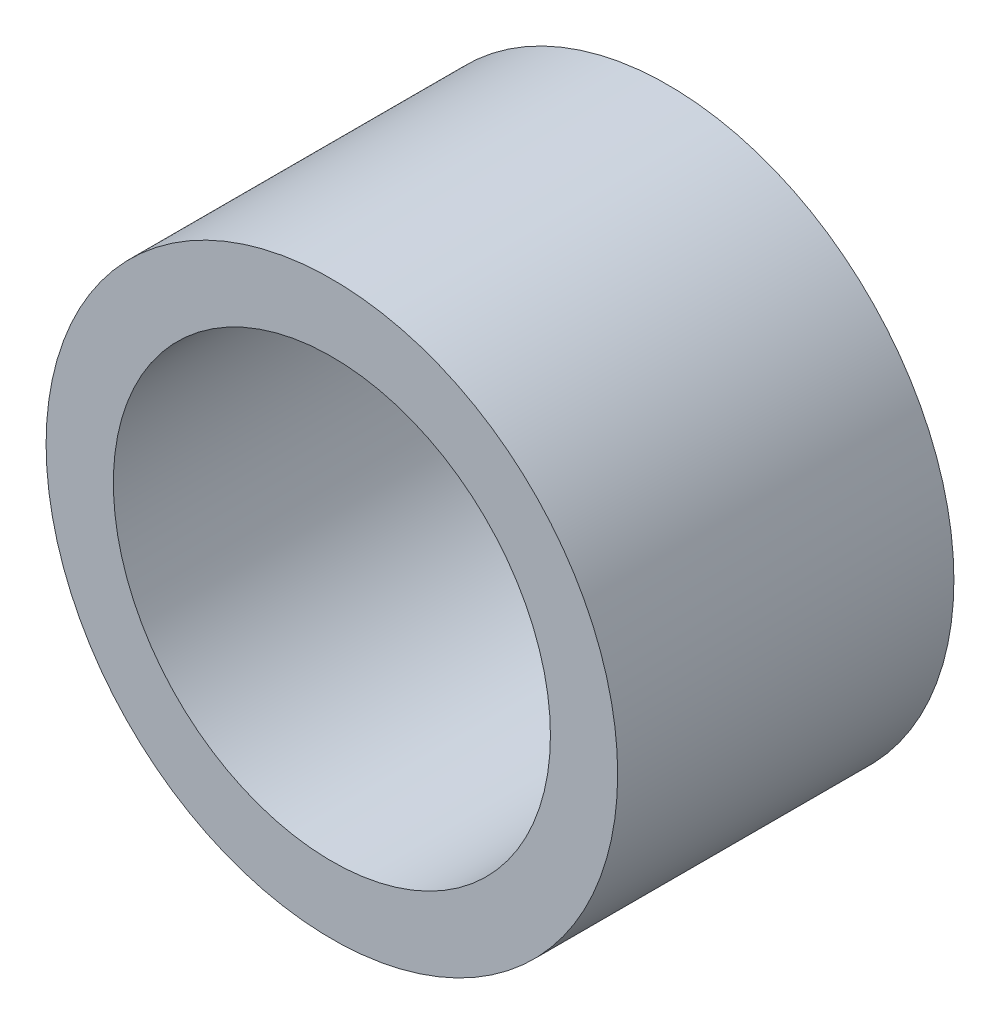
from build123d import *

# Parameters (mm, degrees)
ESQUISSE1_R            = 8.5
ESQUISSE1_R_2          = 6.5
BASE_EXTRU_MINCE_DEPTH = 10


with BuildPart() as part:
    # Esquisse1 → Base-Extru.-Mince (new body)
    with BuildSketch(Plane.XY):
        Circle(ESQUISSE1_R)
        Circle(ESQUISSE1_R_2, mode=Mode.SUBTRACT)
    extrude(amount=BASE_EXTRU_MINCE_DEPTH)


solid = part.part
